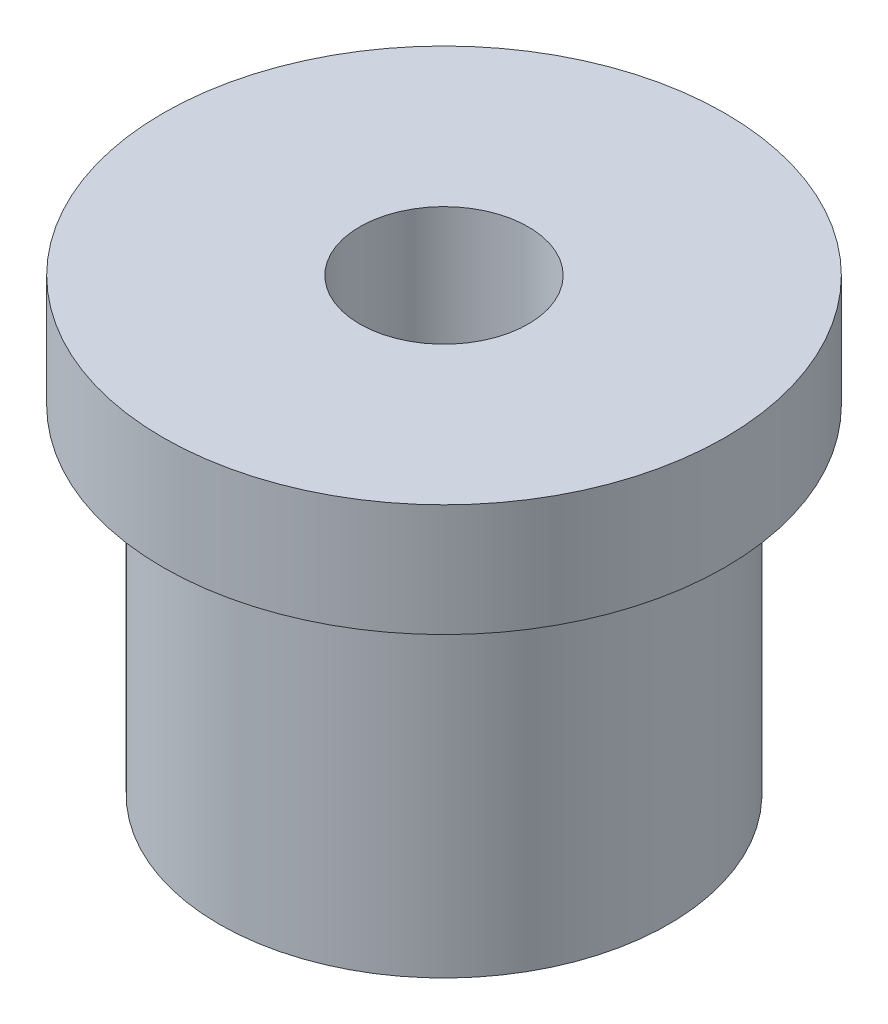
from build123d import *

# Parameters (mm, degrees)
ENL_V_MAT_EXTRU_1_REACH = 12.677
ESQUISSE2_R             = 1.5


with BuildPart() as part:
    # Esquisse1 → R_volution1 (revolve)
    with BuildSketch(Plane.XY, mode=Mode.PRIVATE) as r_volution1_sk:
        Polygon((-5, 8), (0, 8), (0, 0), (-4, 0), (-4, 6), (-5, 6), align=None)
    revolve(r_volution1_sk.sketch.rotate(Axis((0, 8, 0), (0, 1, 0)), 270), axis=Axis((0, 8, 0), (0, 1, 0)))

    # Esquisse2 → Enl_v. mat.-Extru.1 (cut, up to next)
    with BuildSketch(Plane(origin=(0, 8, 0), x_dir=(-1, 0, 0), z_dir=(0, 1, 0)), mode=Mode.PRIVATE) as enl_v_mat_extru_1_sk1:
        with Locations(Location((0, 0, 0), (0, 0, 90))):
            Circle(ESQUISSE2_R)
    enl_v_mat_extru_1_tool1 = extrude(enl_v_mat_extru_1_sk1.sketch, amount=-ENL_V_MAT_EXTRU_1_REACH, mode=Mode.PRIVATE) & part.part
    add(enl_v_mat_extru_1_tool1.solids().sort_by_distance((0, 8, 0))[0], mode=Mode.SUBTRACT)


solid = part.part
